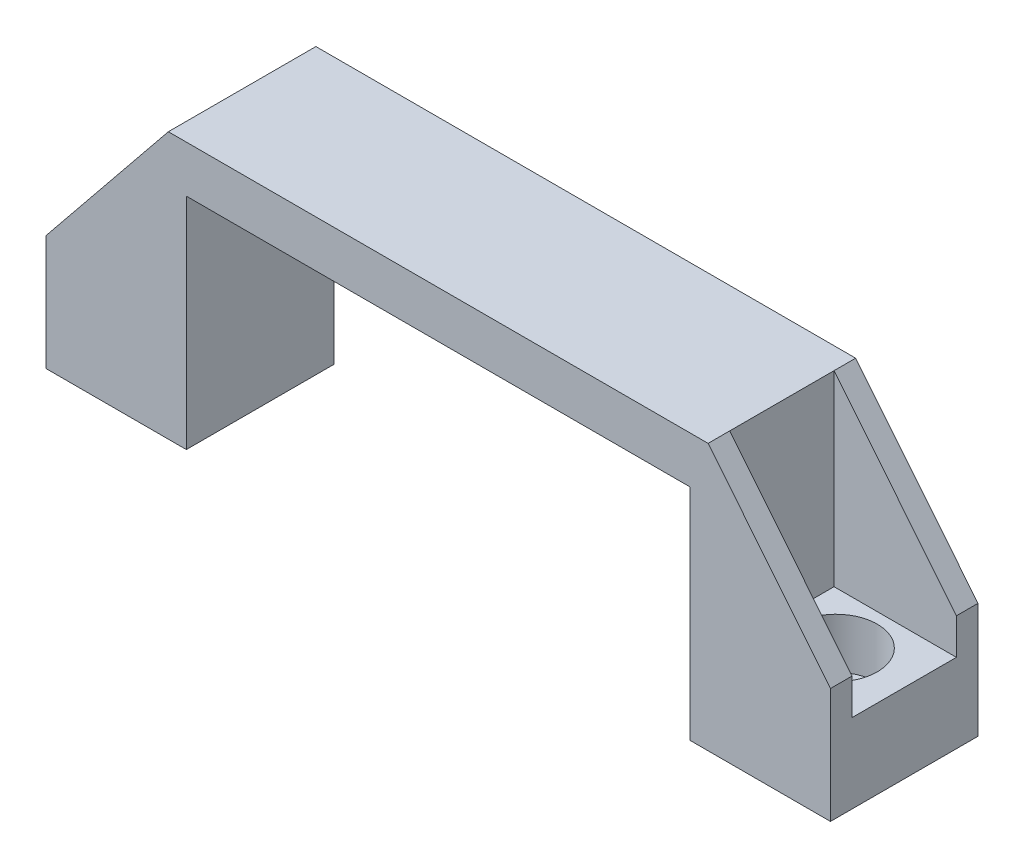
ISO-10303-21;
HEADER;
FILE_DESCRIPTION(('STEP AP214'),'2;1');
FILE_NAME('part.step','',(''),(''),'','','');
FILE_SCHEMA(('AUTOMOTIVE_DESIGN { 1 0 10303 214 1 1 1 1 }'));
ENDSEC;
DATA;
#1=APPLICATION_CONTEXT('core data for automotive mechanical design processes');
#2=APPLICATION_PROTOCOL_DEFINITION('international standard','automotive_design',2000,#1);
#3=PRODUCT_CONTEXT('',#1,'mechanical');
#4=PRODUCT('Part','Part','',(#3));
#5=PRODUCT_RELATED_PRODUCT_CATEGORY('part','',(#4));
#6=PRODUCT_DEFINITION_FORMATION('','',#4);
#7=PRODUCT_DEFINITION_CONTEXT('part definition',#1,'design');
#8=PRODUCT_DEFINITION('design','',#6,#7);
#9=PRODUCT_DEFINITION_SHAPE('','',#8);
#10=(LENGTH_UNIT() NAMED_UNIT(*) SI_UNIT(.MILLI.,.METRE.));
#11=(NAMED_UNIT(*) PLANE_ANGLE_UNIT() SI_UNIT($,.RADIAN.));
#12=(NAMED_UNIT(*) SI_UNIT($,.STERADIAN.) SOLID_ANGLE_UNIT());
#13=UNCERTAINTY_MEASURE_WITH_UNIT(LENGTH_MEASURE(1.E-05),#10,'distance_accuracy_value','');
#14=(GEOMETRIC_REPRESENTATION_CONTEXT(3) GLOBAL_UNCERTAINTY_ASSIGNED_CONTEXT((#13)) GLOBAL_UNIT_ASSIGNED_CONTEXT((#10,
#11,#12)) REPRESENTATION_CONTEXT('',''));
#15=CARTESIAN_POINT('',(0.,0.,0.));
#16=DIRECTION('',(0.,0.,1.));
#17=DIRECTION('',(1.,0.,0.));
#18=AXIS2_PLACEMENT_3D('',#15,#16,#17);
#19=CARTESIAN_POINT('',(45.,37.,0.));
#20=DIRECTION('',(0.,-1.,0.));
#21=DIRECTION('',(0.,0.,-1.));
#22=AXIS2_PLACEMENT_3D('',#19,#20,#21);
#23=CYLINDRICAL_SURFACE('',#22,3.25);
#24=CARTESIAN_POINT('',(45.,0.,0.));
#25=DIRECTION('',(0.,1.,0.));
#26=DIRECTION('',(0.,0.,-1.));
#27=AXIS2_PLACEMENT_3D('',#24,#25,#26);
#28=CIRCLE('',#27,3.25);
#29=CARTESIAN_POINT('',(45.,0.,-3.25));
#30=VERTEX_POINT('',#29);
#31=EDGE_CURVE('E213',#30,#30,#28,.T.);
#32=ORIENTED_EDGE('',*,*,#31,.F.);
#33=EDGE_LOOP('',(#32));
#34=FACE_BOUND('',#33,.T.);
#35=CARTESIAN_POINT('',(45.,3.99999999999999,0.));
#36=DIRECTION('',(0.,1.,0.));
#37=DIRECTION('',(0.,0.,1.));
#38=AXIS2_PLACEMENT_3D('',#35,#36,#37);
#39=CIRCLE('',#38,3.25);
#40=CARTESIAN_POINT('',(45.,3.99999999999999,3.25));
#41=VERTEX_POINT('',#40);
#42=EDGE_CURVE('E37',#41,#41,#39,.T.);
#43=ORIENTED_EDGE('',*,*,#42,.T.);
#44=EDGE_LOOP('',(#43));
#45=FACE_BOUND('',#44,.T.);
#46=ADVANCED_FACE('F33',(#34,#45),#23,.F.);
#47=CARTESIAN_POINT('',(-45.,37.,0.));
#48=DIRECTION('',(0.,-1.,0.));
#49=DIRECTION('',(0.,0.,-1.));
#50=AXIS2_PLACEMENT_3D('',#47,#48,#49);
#51=CYLINDRICAL_SURFACE('',#50,3.25);
#52=CARTESIAN_POINT('',(-45.,0.,0.));
#53=DIRECTION('',(0.,-1.,0.));
#54=DIRECTION('',(0.,0.,-1.));
#55=AXIS2_PLACEMENT_3D('',#52,#53,#54);
#56=CIRCLE('',#55,3.25);
#57=CARTESIAN_POINT('',(-45.,0.,-3.25));
#58=VERTEX_POINT('',#57);
#59=EDGE_CURVE('E220',#58,#58,#56,.T.);
#60=ORIENTED_EDGE('',*,*,#59,.T.);
#61=EDGE_LOOP('',(#60));
#62=FACE_BOUND('',#61,.T.);
#63=CARTESIAN_POINT('',(-45.,3.99999999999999,0.));
#64=DIRECTION('',(0.,1.,0.));
#65=DIRECTION('',(0.,0.,1.));
#66=AXIS2_PLACEMENT_3D('',#63,#64,#65);
#67=CIRCLE('',#66,3.25);
#68=CARTESIAN_POINT('',(-45.,3.99999999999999,3.25));
#69=VERTEX_POINT('',#68);
#70=EDGE_CURVE('E302',#69,#69,#67,.F.);
#71=ORIENTED_EDGE('',*,*,#70,.F.);
#72=EDGE_LOOP('',(#71));
#73=FACE_BOUND('',#72,.T.);
#74=ADVANCED_FACE('F398',(#62,#73),#51,.F.);
#75=CARTESIAN_POINT('',(54.5,16.,10.25));
#76=DIRECTION('',(-0.777244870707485,-0.629198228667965,0.));
#77=DIRECTION('',(0.629198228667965,-0.777244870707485,0.));
#78=AXIS2_PLACEMENT_3D('',#75,#76,#77);
#79=PLANE('',#78);
#80=DIRECTION('',(0.629198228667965,-0.777244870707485,0.));
#81=VECTOR('',#80,1.);
#82=CARTESIAN_POINT('',(54.5,16.,7.25));
#83=LINE('',#82,#81);
#84=CARTESIAN_POINT('',(37.5,37.,7.25));
#85=VERTEX_POINT('',#84);
#86=CARTESIAN_POINT('',(54.5,16.,7.25));
#87=VERTEX_POINT('',#86);
#88=EDGE_CURVE('E192',#85,#87,#83,.T.);
#89=ORIENTED_EDGE('',*,*,#88,.F.);
#90=DIRECTION('',(0.,0.,-1.));
#91=VECTOR('',#90,1.);
#92=CARTESIAN_POINT('',(37.5,37.,10.25));
#93=LINE('',#92,#91);
#94=CARTESIAN_POINT('',(37.5,37.,10.25));
#95=VERTEX_POINT('',#94);
#96=EDGE_CURVE('E277',#95,#85,#93,.T.);
#97=ORIENTED_EDGE('',*,*,#96,.F.);
#98=DIRECTION('',(-0.629198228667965,0.777244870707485,0.));
#99=VECTOR('',#98,1.);
#100=CARTESIAN_POINT('',(54.5,16.,10.25));
#101=LINE('',#100,#99);
#102=CARTESIAN_POINT('',(54.5,16.,10.25));
#103=VERTEX_POINT('',#102);
#104=EDGE_CURVE('E240',#103,#95,#101,.T.);
#105=ORIENTED_EDGE('',*,*,#104,.F.);
#106=DIRECTION('',(0.,0.,-1.));
#107=VECTOR('',#106,1.);
#108=CARTESIAN_POINT('',(54.5,16.,10.25));
#109=LINE('',#108,#107);
#110=EDGE_CURVE('E280',#103,#87,#109,.T.);
#111=ORIENTED_EDGE('',*,*,#110,.T.);
#112=EDGE_LOOP('',(#89,#97,#105,#111));
#113=FACE_BOUND('',#112,.T.);
#114=ADVANCED_FACE('F329',(#113),#79,.F.);
#115=DIRECTION('',(-0.629198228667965,0.777244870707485,0.));
#116=VECTOR('',#115,1.);
#117=CARTESIAN_POINT('',(54.5,16.,-7.25));
#118=LINE('',#117,#116);
#119=CARTESIAN_POINT('',(54.5,16.,-7.25));
#120=VERTEX_POINT('',#119);
#121=CARTESIAN_POINT('',(37.5,37.,-7.25));
#122=VERTEX_POINT('',#121);
#123=EDGE_CURVE('E190',#120,#122,#118,.T.);
#124=ORIENTED_EDGE('',*,*,#123,.F.);
#125=CARTESIAN_POINT('',(54.5,16.,-10.25));
#126=VERTEX_POINT('',#125);
#127=EDGE_CURVE('E183',#120,#126,#109,.T.);
#128=ORIENTED_EDGE('',*,*,#127,.T.);
#129=DIRECTION('',(-0.629198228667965,0.777244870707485,0.));
#130=VECTOR('',#129,1.);
#131=CARTESIAN_POINT('',(54.5,16.,-10.25));
#132=LINE('',#131,#130);
#133=CARTESIAN_POINT('',(37.5,37.,-10.25));
#134=VERTEX_POINT('',#133);
#135=EDGE_CURVE('E261',#126,#134,#132,.T.);
#136=ORIENTED_EDGE('',*,*,#135,.T.);
#137=EDGE_CURVE('E276',#122,#134,#93,.T.);
#138=ORIENTED_EDGE('',*,*,#137,.F.);
#139=EDGE_LOOP('',(#124,#128,#136,#138));
#140=FACE_BOUND('',#139,.T.);
#141=ADVANCED_FACE('F355',(#140),#79,.F.);
#142=CARTESIAN_POINT('',(54.5,0.,10.25));
#143=DIRECTION('',(-1.,0.,0.));
#144=DIRECTION('',(0.,-1.,0.));
#145=AXIS2_PLACEMENT_3D('',#142,#143,#144);
#146=PLANE('',#145);
#147=DIRECTION('',(0.,1.,0.));
#148=VECTOR('',#147,1.);
#149=CARTESIAN_POINT('',(54.5,11.,7.25));
#150=LINE('',#149,#148);
#151=CARTESIAN_POINT('',(54.5,11.,7.25));
#152=VERTEX_POINT('',#151);
#153=EDGE_CURVE('E193',#152,#87,#150,.T.);
#154=ORIENTED_EDGE('',*,*,#153,.T.);
#155=ORIENTED_EDGE('',*,*,#110,.F.);
#156=DIRECTION('',(0.,1.,0.));
#157=VECTOR('',#156,1.);
#158=CARTESIAN_POINT('',(54.5,0.,10.25));
#159=LINE('',#158,#157);
#160=CARTESIAN_POINT('',(54.5,0.,10.25));
#161=VERTEX_POINT('',#160);
#162=EDGE_CURVE('E238',#161,#103,#159,.T.);
#163=ORIENTED_EDGE('',*,*,#162,.F.);
#164=DIRECTION('',(0.,0.,-1.));
#165=VECTOR('',#164,1.);
#166=CARTESIAN_POINT('',(54.5,0.,10.25));
#167=LINE('',#166,#165);
#168=CARTESIAN_POINT('',(54.5,0.,-10.25));
#169=VERTEX_POINT('',#168);
#170=EDGE_CURVE('E283',#161,#169,#167,.T.);
#171=ORIENTED_EDGE('',*,*,#170,.T.);
#172=DIRECTION('',(0.,1.,0.));
#173=VECTOR('',#172,1.);
#174=CARTESIAN_POINT('',(54.5,0.,-10.25));
#175=LINE('',#174,#173);
#176=EDGE_CURVE('E259',#169,#126,#175,.T.);
#177=ORIENTED_EDGE('',*,*,#176,.T.);
#178=ORIENTED_EDGE('',*,*,#127,.F.);
#179=DIRECTION('',(0.,1.,0.));
#180=VECTOR('',#179,1.);
#181=CARTESIAN_POINT('',(54.5,11.,-7.25));
#182=LINE('',#181,#180);
#183=CARTESIAN_POINT('',(54.5,11.,-7.25));
#184=VERTEX_POINT('',#183);
#185=EDGE_CURVE('E165',#184,#120,#182,.T.);
#186=ORIENTED_EDGE('',*,*,#185,.F.);
#187=DIRECTION('',(0.,0.,1.));
#188=VECTOR('',#187,1.);
#189=CARTESIAN_POINT('',(54.5,11.,-7.25));
#190=LINE('',#189,#188);
#191=EDGE_CURVE('E170',#184,#152,#190,.T.);
#192=ORIENTED_EDGE('',*,*,#191,.T.);
#193=EDGE_LOOP('',(#154,#155,#163,#171,#177,#178,#186,#192));
#194=FACE_BOUND('',#193,.T.);
#195=ADVANCED_FACE('F181',(#194),#146,.F.);
#196=CARTESIAN_POINT('',(-37.5,37.,10.25));
#197=DIRECTION('',(0.777244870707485,-0.629198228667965,0.));
#198=DIRECTION('',(0.629198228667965,0.777244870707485,0.));
#199=AXIS2_PLACEMENT_3D('',#196,#197,#198);
#200=PLANE('',#199);
#201=DIRECTION('',(0.,0.,-1.));
#202=VECTOR('',#201,1.);
#203=CARTESIAN_POINT('',(-54.5,16.,10.25));
#204=LINE('',#203,#202);
#205=CARTESIAN_POINT('',(-54.5,16.,-7.25));
#206=VERTEX_POINT('',#205);
#207=CARTESIAN_POINT('',(-54.5,16.,-10.25));
#208=VERTEX_POINT('',#207);
#209=EDGE_CURVE('E246',#206,#208,#204,.T.);
#210=ORIENTED_EDGE('',*,*,#209,.F.);
#211=DIRECTION('',(0.629198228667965,0.777244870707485,0.));
#212=VECTOR('',#211,1.);
#213=CARTESIAN_POINT('',(-37.5,37.,-7.25));
#214=LINE('',#213,#212);
#215=CARTESIAN_POINT('',(-37.5,37.,-7.25));
#216=VERTEX_POINT('',#215);
#217=EDGE_CURVE('E11',#206,#216,#214,.T.);
#218=ORIENTED_EDGE('',*,*,#217,.T.);
#219=DIRECTION('',(0.,0.,-1.));
#220=VECTOR('',#219,1.);
#221=CARTESIAN_POINT('',(-37.5,37.,10.25));
#222=LINE('',#221,#220);
#223=CARTESIAN_POINT('',(-37.5,37.,-10.25));
#224=VERTEX_POINT('',#223);
#225=EDGE_CURVE('E272',#216,#224,#222,.T.);
#226=ORIENTED_EDGE('',*,*,#225,.T.);
#227=DIRECTION('',(-0.629198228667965,-0.777244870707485,0.));
#228=VECTOR('',#227,1.);
#229=CARTESIAN_POINT('',(-37.5,37.,-10.25));
#230=LINE('',#229,#228);
#231=EDGE_CURVE('E228',#224,#208,#230,.T.);
#232=ORIENTED_EDGE('',*,*,#231,.T.);
#233=EDGE_LOOP('',(#210,#218,#226,#232));
#234=FACE_BOUND('',#233,.T.);
#235=ADVANCED_FACE('F359',(#234),#200,.F.);
#236=CARTESIAN_POINT('',(35.,0.,10.25));
#237=DIRECTION('',(0.,1.,0.));
#238=DIRECTION('',(0.,0.,1.));
#239=AXIS2_PLACEMENT_3D('',#236,#237,#238);
#240=PLANE('',#239);
#241=DIRECTION('',(1.,0.,0.));
#242=VECTOR('',#241,1.);
#243=CARTESIAN_POINT('',(35.,0.,-10.25));
#244=LINE('',#243,#242);
#245=CARTESIAN_POINT('',(35.,0.,-10.25));
#246=VERTEX_POINT('',#245);
#247=EDGE_CURVE('E257',#246,#169,#244,.T.);
#248=ORIENTED_EDGE('',*,*,#247,.T.);
#249=ORIENTED_EDGE('',*,*,#170,.F.);
#250=DIRECTION('',(1.,0.,0.));
#251=VECTOR('',#250,1.);
#252=CARTESIAN_POINT('',(35.,0.,10.25));
#253=LINE('',#252,#251);
#254=CARTESIAN_POINT('',(35.,0.,10.25));
#255=VERTEX_POINT('',#254);
#256=EDGE_CURVE('E236',#255,#161,#253,.T.);
#257=ORIENTED_EDGE('',*,*,#256,.F.);
#258=DIRECTION('',(0.,0.,-1.));
#259=VECTOR('',#258,1.);
#260=CARTESIAN_POINT('',(35.,0.,10.25));
#261=LINE('',#260,#259);
#262=EDGE_CURVE('E286',#255,#246,#261,.T.);
#263=ORIENTED_EDGE('',*,*,#262,.T.);
#264=EDGE_LOOP('',(#248,#249,#257,#263));
#265=FACE_BOUND('',#264,.T.);
#266=ORIENTED_EDGE('',*,*,#31,.T.);
#267=EDGE_LOOP('',(#266));
#268=FACE_BOUND('',#267,.T.);
#269=ADVANCED_FACE('F390',(#265,#268),#240,.F.);
#270=CARTESIAN_POINT('',(-54.5,16.,10.25));
#271=DIRECTION('',(1.,0.,0.));
#272=DIRECTION('',(0.,0.,-1.));
#273=AXIS2_PLACEMENT_3D('',#270,#271,#272);
#274=PLANE('',#273);
#275=DIRECTION('',(0.,0.,1.));
#276=VECTOR('',#275,1.);
#277=CARTESIAN_POINT('',(-54.5,11.,-7.25));
#278=LINE('',#277,#276);
#279=CARTESIAN_POINT('',(-54.5,11.,-7.25));
#280=VERTEX_POINT('',#279);
#281=CARTESIAN_POINT('',(-54.5,11.,7.25));
#282=VERTEX_POINT('',#281);
#283=EDGE_CURVE('E196',#280,#282,#278,.T.);
#284=ORIENTED_EDGE('',*,*,#283,.F.);
#285=DIRECTION('',(0.,1.,0.));
#286=VECTOR('',#285,1.);
#287=CARTESIAN_POINT('',(-54.5,11.,-7.25));
#288=LINE('',#287,#286);
#289=EDGE_CURVE('E210',#280,#206,#288,.T.);
#290=ORIENTED_EDGE('',*,*,#289,.T.);
#291=ORIENTED_EDGE('',*,*,#209,.T.);
#292=DIRECTION('',(0.,-1.,0.));
#293=VECTOR('',#292,1.);
#294=CARTESIAN_POINT('',(-54.5,16.,-10.25));
#295=LINE('',#294,#293);
#296=CARTESIAN_POINT('',(-54.5,0.,-10.25));
#297=VERTEX_POINT('',#296);
#298=EDGE_CURVE('E223',#208,#297,#295,.T.);
#299=ORIENTED_EDGE('',*,*,#298,.T.);
#300=DIRECTION('',(0.,0.,-1.));
#301=VECTOR('',#300,1.);
#302=CARTESIAN_POINT('',(-54.5,0.,10.25));
#303=LINE('',#302,#301);
#304=CARTESIAN_POINT('',(-54.5,0.,10.25));
#305=VERTEX_POINT('',#304);
#306=EDGE_CURVE('E298',#305,#297,#303,.T.);
#307=ORIENTED_EDGE('',*,*,#306,.F.);
#308=DIRECTION('',(0.,-1.,0.));
#309=VECTOR('',#308,1.);
#310=CARTESIAN_POINT('',(-54.5,16.,10.25));
#311=LINE('',#310,#309);
#312=CARTESIAN_POINT('',(-54.5,16.,10.25));
#313=VERTEX_POINT('',#312);
#314=EDGE_CURVE('E224',#313,#305,#311,.T.);
#315=ORIENTED_EDGE('',*,*,#314,.F.);
#316=CARTESIAN_POINT('',(-54.5,16.,7.25));
#317=VERTEX_POINT('',#316);
#318=EDGE_CURVE('E269',#313,#317,#204,.T.);
#319=ORIENTED_EDGE('',*,*,#318,.T.);
#320=DIRECTION('',(0.,1.,0.));
#321=VECTOR('',#320,1.);
#322=CARTESIAN_POINT('',(-54.5,11.,7.25));
#323=LINE('',#322,#321);
#324=EDGE_CURVE('E208',#282,#317,#323,.T.);
#325=ORIENTED_EDGE('',*,*,#324,.F.);
#326=EDGE_LOOP('',(#284,#290,#291,#299,#307,#315,#319,#325));
#327=FACE_BOUND('',#326,.T.);
#328=ADVANCED_FACE('F35',(#327),#274,.F.);
#329=CARTESIAN_POINT('',(-54.5,0.,10.25));
#330=DIRECTION('',(0.,1.,0.));
#331=DIRECTION('',(0.,0.,1.));
#332=AXIS2_PLACEMENT_3D('',#329,#330,#331);
#333=PLANE('',#332);
#334=ORIENTED_EDGE('',*,*,#59,.F.);
#335=EDGE_LOOP('',(#334));
#336=FACE_BOUND('',#335,.T.);
#337=DIRECTION('',(1.,0.,0.));
#338=VECTOR('',#337,1.);
#339=CARTESIAN_POINT('',(-54.5,0.,-10.25));
#340=LINE('',#339,#338);
#341=CARTESIAN_POINT('',(-35.,0.,-10.25));
#342=VERTEX_POINT('',#341);
#343=EDGE_CURVE('E249',#297,#342,#340,.T.);
#344=ORIENTED_EDGE('',*,*,#343,.T.);
#345=DIRECTION('',(0.,0.,-1.));
#346=VECTOR('',#345,1.);
#347=CARTESIAN_POINT('',(-35.,0.,10.25));
#348=LINE('',#347,#346);
#349=CARTESIAN_POINT('',(-35.,0.,10.25));
#350=VERTEX_POINT('',#349);
#351=EDGE_CURVE('E295',#350,#342,#348,.T.);
#352=ORIENTED_EDGE('',*,*,#351,.F.);
#353=DIRECTION('',(1.,0.,0.));
#354=VECTOR('',#353,1.);
#355=CARTESIAN_POINT('',(-54.5,0.,10.25));
#356=LINE('',#355,#354);
#357=EDGE_CURVE('E227',#305,#350,#356,.T.);
#358=ORIENTED_EDGE('',*,*,#357,.F.);
#359=ORIENTED_EDGE('',*,*,#306,.T.);
#360=EDGE_LOOP('',(#344,#352,#358,#359));
#361=FACE_BOUND('',#360,.T.);
#362=ADVANCED_FACE('F377',(#336,#361),#333,.F.);
#363=CARTESIAN_POINT('',(-35.,0.,10.25));
#364=DIRECTION('',(-1.,0.,0.));
#365=DIRECTION('',(0.,0.,1.));
#366=AXIS2_PLACEMENT_3D('',#363,#364,#365);
#367=PLANE('',#366);
#368=DIRECTION('',(0.,1.,0.));
#369=VECTOR('',#368,1.);
#370=CARTESIAN_POINT('',(-35.,0.,-10.25));
#371=LINE('',#370,#369);
#372=CARTESIAN_POINT('',(-35.,30.5,-10.25));
#373=VERTEX_POINT('',#372);
#374=EDGE_CURVE('E251',#342,#373,#371,.T.);
#375=ORIENTED_EDGE('',*,*,#374,.T.);
#376=DIRECTION('',(0.,0.,-1.));
#377=VECTOR('',#376,1.);
#378=CARTESIAN_POINT('',(-35.,30.5,10.25));
#379=LINE('',#378,#377);
#380=CARTESIAN_POINT('',(-35.,30.5,10.25));
#381=VERTEX_POINT('',#380);
#382=EDGE_CURVE('E292',#381,#373,#379,.T.);
#383=ORIENTED_EDGE('',*,*,#382,.F.);
#384=DIRECTION('',(0.,1.,0.));
#385=VECTOR('',#384,1.);
#386=CARTESIAN_POINT('',(-35.,0.,10.25));
#387=LINE('',#386,#385);
#388=EDGE_CURVE('E230',#350,#381,#387,.T.);
#389=ORIENTED_EDGE('',*,*,#388,.F.);
#390=ORIENTED_EDGE('',*,*,#351,.T.);
#391=EDGE_LOOP('',(#375,#383,#389,#390));
#392=FACE_BOUND('',#391,.T.);
#393=ADVANCED_FACE('F380',(#392),#367,.F.);
#394=CARTESIAN_POINT('',(-35.,30.5,10.25));
#395=DIRECTION('',(0.,1.,0.));
#396=DIRECTION('',(0.,0.,1.));
#397=AXIS2_PLACEMENT_3D('',#394,#395,#396);
#398=PLANE('',#397);
#399=DIRECTION('',(1.,0.,0.));
#400=VECTOR('',#399,1.);
#401=CARTESIAN_POINT('',(-35.,30.5,-10.25));
#402=LINE('',#401,#400);
#403=CARTESIAN_POINT('',(35.,30.5,-10.25));
#404=VERTEX_POINT('',#403);
#405=EDGE_CURVE('E253',#373,#404,#402,.T.);
#406=ORIENTED_EDGE('',*,*,#405,.T.);
#407=DIRECTION('',(0.,0.,-1.));
#408=VECTOR('',#407,1.);
#409=CARTESIAN_POINT('',(35.,30.5,10.25));
#410=LINE('',#409,#408);
#411=CARTESIAN_POINT('',(35.,30.5,10.25));
#412=VERTEX_POINT('',#411);
#413=EDGE_CURVE('E289',#412,#404,#410,.T.);
#414=ORIENTED_EDGE('',*,*,#413,.F.);
#415=DIRECTION('',(1.,0.,0.));
#416=VECTOR('',#415,1.);
#417=CARTESIAN_POINT('',(-35.,30.5,10.25));
#418=LINE('',#417,#416);
#419=EDGE_CURVE('E232',#381,#412,#418,.T.);
#420=ORIENTED_EDGE('',*,*,#419,.F.);
#421=ORIENTED_EDGE('',*,*,#382,.T.);
#422=EDGE_LOOP('',(#406,#414,#420,#421));
#423=FACE_BOUND('',#422,.T.);
#424=ADVANCED_FACE('F385',(#423),#398,.F.);
#425=CARTESIAN_POINT('',(35.,30.5,10.25));
#426=DIRECTION('',(1.,0.,0.));
#427=DIRECTION('',(0.,1.,0.));
#428=AXIS2_PLACEMENT_3D('',#425,#426,#427);
#429=PLANE('',#428);
#430=DIRECTION('',(0.,-1.,0.));
#431=VECTOR('',#430,1.);
#432=CARTESIAN_POINT('',(35.,30.5,-10.25));
#433=LINE('',#432,#431);
#434=EDGE_CURVE('E255',#404,#246,#433,.T.);
#435=ORIENTED_EDGE('',*,*,#434,.T.);
#436=ORIENTED_EDGE('',*,*,#262,.F.);
#437=DIRECTION('',(0.,-1.,0.));
#438=VECTOR('',#437,1.);
#439=CARTESIAN_POINT('',(35.,30.5,10.25));
#440=LINE('',#439,#438);
#441=EDGE_CURVE('E234',#412,#255,#440,.T.);
#442=ORIENTED_EDGE('',*,*,#441,.F.);
#443=ORIENTED_EDGE('',*,*,#413,.T.);
#444=EDGE_LOOP('',(#435,#436,#442,#443));
#445=FACE_BOUND('',#444,.T.);
#446=ADVANCED_FACE('F389',(#445),#429,.F.);
#447=CARTESIAN_POINT('',(37.5,37.,10.25));
#448=DIRECTION('',(0.,-1.,0.));
#449=DIRECTION('',(0.,0.,-1.));
#450=AXIS2_PLACEMENT_3D('',#447,#448,#449);
#451=PLANE('',#450);
#452=DIRECTION('',(-1.,0.,0.));
#453=VECTOR('',#452,1.);
#454=CARTESIAN_POINT('',(37.5,37.,-10.25));
#455=LINE('',#454,#453);
#456=EDGE_CURVE('E264',#134,#224,#455,.T.);
#457=ORIENTED_EDGE('',*,*,#456,.T.);
#458=ORIENTED_EDGE('',*,*,#225,.F.);
#459=DIRECTION('',(0.,0.,-1.));
#460=VECTOR('',#459,1.);
#461=CARTESIAN_POINT('',(-37.5,37.,-7.25));
#462=LINE('',#461,#460);
#463=CARTESIAN_POINT('',(-37.5,37.,7.25));
#464=VERTEX_POINT('',#463);
#465=EDGE_CURVE('E195',#464,#216,#462,.T.);
#466=ORIENTED_EDGE('',*,*,#465,.F.);
#467=CARTESIAN_POINT('',(-37.5,37.,10.25));
#468=VERTEX_POINT('',#467);
#469=EDGE_CURVE('E273',#468,#464,#222,.T.);
#470=ORIENTED_EDGE('',*,*,#469,.F.);
#471=DIRECTION('',(-1.,0.,0.));
#472=VECTOR('',#471,1.);
#473=CARTESIAN_POINT('',(37.5,37.,10.25));
#474=LINE('',#473,#472);
#475=EDGE_CURVE('E242',#95,#468,#474,.T.);
#476=ORIENTED_EDGE('',*,*,#475,.F.);
#477=ORIENTED_EDGE('',*,*,#96,.T.);
#478=DIRECTION('',(0.,0.,-1.));
#479=VECTOR('',#478,1.);
#480=CARTESIAN_POINT('',(37.5,37.,-7.25));
#481=LINE('',#480,#479);
#482=EDGE_CURVE('E178',#85,#122,#481,.T.);
#483=ORIENTED_EDGE('',*,*,#482,.T.);
#484=ORIENTED_EDGE('',*,*,#137,.T.);
#485=EDGE_LOOP('',(#457,#458,#466,#470,#476,#477,#483,#484));
#486=FACE_BOUND('',#485,.T.);
#487=ADVANCED_FACE('F333',(#486),#451,.F.);
#488=ORIENTED_EDGE('',*,*,#469,.T.);
#489=DIRECTION('',(-0.629198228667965,-0.777244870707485,0.));
#490=VECTOR('',#489,1.);
#491=CARTESIAN_POINT('',(-37.5,37.,7.25));
#492=LINE('',#491,#490);
#493=EDGE_CURVE('E42',#464,#317,#492,.T.);
#494=ORIENTED_EDGE('',*,*,#493,.T.);
#495=ORIENTED_EDGE('',*,*,#318,.F.);
#496=DIRECTION('',(-0.629198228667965,-0.777244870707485,0.));
#497=VECTOR('',#496,1.);
#498=CARTESIAN_POINT('',(-37.5,37.,10.25));
#499=LINE('',#498,#497);
#500=EDGE_CURVE('E244',#468,#313,#499,.T.);
#501=ORIENTED_EDGE('',*,*,#500,.F.);
#502=EDGE_LOOP('',(#488,#494,#495,#501));
#503=FACE_BOUND('',#502,.T.);
#504=ADVANCED_FACE('F370',(#503),#200,.F.);
#505=CARTESIAN_POINT('',(0.,0.,10.25));
#506=DIRECTION('',(0.,0.,1.));
#507=DIRECTION('',(1.,0.,0.));
#508=AXIS2_PLACEMENT_3D('',#505,#506,#507);
#509=PLANE('',#508);
#510=ORIENTED_EDGE('',*,*,#314,.T.);
#511=ORIENTED_EDGE('',*,*,#357,.T.);
#512=ORIENTED_EDGE('',*,*,#388,.T.);
#513=ORIENTED_EDGE('',*,*,#419,.T.);
#514=ORIENTED_EDGE('',*,*,#441,.T.);
#515=ORIENTED_EDGE('',*,*,#256,.T.);
#516=ORIENTED_EDGE('',*,*,#162,.T.);
#517=ORIENTED_EDGE('',*,*,#104,.T.);
#518=ORIENTED_EDGE('',*,*,#475,.T.);
#519=ORIENTED_EDGE('',*,*,#500,.T.);
#520=EDGE_LOOP('',(#510,#511,#512,#513,#514,#515,#516,#517,#518,#519));
#521=FACE_BOUND('',#520,.T.);
#522=ADVANCED_FACE('F338',(#521),#509,.T.);
#523=CARTESIAN_POINT('',(0.,0.,-10.25));
#524=DIRECTION('',(0.,0.,1.));
#525=DIRECTION('',(1.,0.,0.));
#526=AXIS2_PLACEMENT_3D('',#523,#524,#525);
#527=PLANE('',#526);
#528=ORIENTED_EDGE('',*,*,#298,.F.);
#529=ORIENTED_EDGE('',*,*,#231,.F.);
#530=ORIENTED_EDGE('',*,*,#456,.F.);
#531=ORIENTED_EDGE('',*,*,#135,.F.);
#532=ORIENTED_EDGE('',*,*,#176,.F.);
#533=ORIENTED_EDGE('',*,*,#247,.F.);
#534=ORIENTED_EDGE('',*,*,#434,.F.);
#535=ORIENTED_EDGE('',*,*,#405,.F.);
#536=ORIENTED_EDGE('',*,*,#374,.F.);
#537=ORIENTED_EDGE('',*,*,#343,.F.);
#538=EDGE_LOOP('',(#528,#529,#530,#531,#532,#533,#534,#535,#536,#537));
#539=FACE_BOUND('',#538,.T.);
#540=ADVANCED_FACE('F349',(#539),#527,.F.);
#541=CARTESIAN_POINT('',(-54.5,11.,-7.25));
#542=DIRECTION('',(0.,0.,-1.));
#543=DIRECTION('',(-1.,0.,0.));
#544=AXIS2_PLACEMENT_3D('',#541,#542,#543);
#545=PLANE('',#544);
#546=ORIENTED_EDGE('',*,*,#289,.F.);
#547=DIRECTION('',(-1.,0.,0.));
#548=VECTOR('',#547,1.);
#549=CARTESIAN_POINT('',(-54.5,11.,-7.25));
#550=LINE('',#549,#548);
#551=CARTESIAN_POINT('',(-37.5,11.,-7.25));
#552=VERTEX_POINT('',#551);
#553=EDGE_CURVE('E205',#552,#280,#550,.T.);
#554=ORIENTED_EDGE('',*,*,#553,.F.);
#555=DIRECTION('',(0.,1.,0.));
#556=VECTOR('',#555,1.);
#557=CARTESIAN_POINT('',(-37.5,11.,-7.25));
#558=LINE('',#557,#556);
#559=EDGE_CURVE('E214',#552,#216,#558,.T.);
#560=ORIENTED_EDGE('',*,*,#559,.T.);
#561=ORIENTED_EDGE('',*,*,#217,.F.);
#562=EDGE_LOOP('',(#546,#554,#560,#561));
#563=FACE_BOUND('',#562,.T.);
#564=ADVANCED_FACE('F361',(#563),#545,.F.);
#565=CARTESIAN_POINT('',(-54.5,11.,7.25));
#566=DIRECTION('',(0.,0.,1.));
#567=DIRECTION('',(1.,0.,0.));
#568=AXIS2_PLACEMENT_3D('',#565,#566,#567);
#569=PLANE('',#568);
#570=DIRECTION('',(0.,1.,0.));
#571=VECTOR('',#570,1.);
#572=CARTESIAN_POINT('',(-37.5,11.,7.25));
#573=LINE('',#572,#571);
#574=CARTESIAN_POINT('',(-37.5,11.,7.25));
#575=VERTEX_POINT('',#574);
#576=EDGE_CURVE('E58',#575,#464,#573,.T.);
#577=ORIENTED_EDGE('',*,*,#576,.F.);
#578=DIRECTION('',(1.,0.,0.));
#579=VECTOR('',#578,1.);
#580=CARTESIAN_POINT('',(-54.5,11.,7.25));
#581=LINE('',#580,#579);
#582=EDGE_CURVE('E199',#282,#575,#581,.T.);
#583=ORIENTED_EDGE('',*,*,#582,.F.);
#584=ORIENTED_EDGE('',*,*,#324,.T.);
#585=ORIENTED_EDGE('',*,*,#493,.F.);
#586=EDGE_LOOP('',(#577,#583,#584,#585));
#587=FACE_BOUND('',#586,.T.);
#588=ADVANCED_FACE('F430',(#587),#569,.F.);
#589=CARTESIAN_POINT('',(0.,11.,0.));
#590=DIRECTION('',(0.,1.,0.));
#591=DIRECTION('',(0.,0.,1.));
#592=AXIS2_PLACEMENT_3D('',#589,#590,#591);
#593=PLANE('',#592);
#594=CARTESIAN_POINT('',(-45.,11.,0.));
#595=DIRECTION('',(0.,1.,0.));
#596=DIRECTION('',(0.,0.,1.));
#597=AXIS2_PLACEMENT_3D('',#594,#595,#596);
#598=CIRCLE('',#597,5.75);
#599=CARTESIAN_POINT('',(-45.,11.,5.75));
#600=VERTEX_POINT('',#599);
#601=EDGE_CURVE('E310',#600,#600,#598,.T.);
#602=ORIENTED_EDGE('',*,*,#601,.F.);
#603=EDGE_LOOP('',(#602));
#604=FACE_BOUND('',#603,.T.);
#605=ORIENTED_EDGE('',*,*,#283,.T.);
#606=ORIENTED_EDGE('',*,*,#582,.T.);
#607=DIRECTION('',(0.,0.,-1.));
#608=VECTOR('',#607,1.);
#609=CARTESIAN_POINT('',(-37.5,11.,-7.25));
#610=LINE('',#609,#608);
#611=EDGE_CURVE('E202',#575,#552,#610,.T.);
#612=ORIENTED_EDGE('',*,*,#611,.T.);
#613=ORIENTED_EDGE('',*,*,#553,.T.);
#614=EDGE_LOOP('',(#605,#606,#612,#613));
#615=FACE_BOUND('',#614,.T.);
#616=ADVANCED_FACE('F367',(#604,#615),#593,.T.);
#617=CARTESIAN_POINT('',(-37.5,11.,-7.25));
#618=DIRECTION('',(1.,0.,0.));
#619=DIRECTION('',(0.,0.,-1.));
#620=AXIS2_PLACEMENT_3D('',#617,#618,#619);
#621=PLANE('',#620);
#622=ORIENTED_EDGE('',*,*,#465,.T.);
#623=ORIENTED_EDGE('',*,*,#559,.F.);
#624=ORIENTED_EDGE('',*,*,#611,.F.);
#625=ORIENTED_EDGE('',*,*,#576,.T.);
#626=EDGE_LOOP('',(#622,#623,#624,#625));
#627=FACE_BOUND('',#626,.T.);
#628=ADVANCED_FACE('F368',(#627),#621,.F.);
#629=CARTESIAN_POINT('',(54.5,11.,7.25));
#630=DIRECTION('',(0.,0.,-1.));
#631=DIRECTION('',(-1.,0.,0.));
#632=AXIS2_PLACEMENT_3D('',#629,#630,#631);
#633=PLANE('',#632);
#634=ORIENTED_EDGE('',*,*,#88,.T.);
#635=ORIENTED_EDGE('',*,*,#153,.F.);
#636=DIRECTION('',(-1.,0.,0.));
#637=VECTOR('',#636,1.);
#638=CARTESIAN_POINT('',(54.5,11.,7.25));
#639=LINE('',#638,#637);
#640=CARTESIAN_POINT('',(37.5,11.,7.25));
#641=VERTEX_POINT('',#640);
#642=EDGE_CURVE('E174',#152,#641,#639,.T.);
#643=ORIENTED_EDGE('',*,*,#642,.T.);
#644=DIRECTION('',(0.,1.,0.));
#645=VECTOR('',#644,1.);
#646=CARTESIAN_POINT('',(37.5,11.,7.25));
#647=LINE('',#646,#645);
#648=EDGE_CURVE('E185',#641,#85,#647,.T.);
#649=ORIENTED_EDGE('',*,*,#648,.T.);
#650=EDGE_LOOP('',(#634,#635,#643,#649));
#651=FACE_BOUND('',#650,.T.);
#652=ADVANCED_FACE('F323',(#651),#633,.T.);
#653=CARTESIAN_POINT('',(54.5,11.,-7.25));
#654=DIRECTION('',(0.,0.,1.));
#655=DIRECTION('',(1.,0.,0.));
#656=AXIS2_PLACEMENT_3D('',#653,#654,#655);
#657=PLANE('',#656);
#658=ORIENTED_EDGE('',*,*,#123,.T.);
#659=DIRECTION('',(0.,1.,0.));
#660=VECTOR('',#659,1.);
#661=CARTESIAN_POINT('',(37.5,11.,-7.25));
#662=LINE('',#661,#660);
#663=CARTESIAN_POINT('',(37.5,11.,-7.25));
#664=VERTEX_POINT('',#663);
#665=EDGE_CURVE('E50',#664,#122,#662,.T.);
#666=ORIENTED_EDGE('',*,*,#665,.F.);
#667=DIRECTION('',(1.,0.,0.));
#668=VECTOR('',#667,1.);
#669=CARTESIAN_POINT('',(54.5,11.,-7.25));
#670=LINE('',#669,#668);
#671=EDGE_CURVE('E161',#664,#184,#670,.T.);
#672=ORIENTED_EDGE('',*,*,#671,.T.);
#673=ORIENTED_EDGE('',*,*,#185,.T.);
#674=EDGE_LOOP('',(#658,#666,#672,#673));
#675=FACE_BOUND('',#674,.T.);
#676=ADVANCED_FACE('F163',(#675),#657,.T.);
#677=CARTESIAN_POINT('',(37.5,11.,-7.25));
#678=DIRECTION('',(1.,0.,0.));
#679=DIRECTION('',(0.,0.,-1.));
#680=AXIS2_PLACEMENT_3D('',#677,#678,#679);
#681=PLANE('',#680);
#682=ORIENTED_EDGE('',*,*,#482,.F.);
#683=ORIENTED_EDGE('',*,*,#648,.F.);
#684=DIRECTION('',(0.,0.,-1.));
#685=VECTOR('',#684,1.);
#686=CARTESIAN_POINT('',(37.5,11.,-7.25));
#687=LINE('',#686,#685);
#688=EDGE_CURVE('E169',#641,#664,#687,.T.);
#689=ORIENTED_EDGE('',*,*,#688,.T.);
#690=ORIENTED_EDGE('',*,*,#665,.T.);
#691=EDGE_LOOP('',(#682,#683,#689,#690));
#692=FACE_BOUND('',#691,.T.);
#693=ADVANCED_FACE('F325',(#692),#681,.T.);
#694=CARTESIAN_POINT('',(0.,11.,0.));
#695=DIRECTION('',(0.,1.,0.));
#696=DIRECTION('',(0.,0.,1.));
#697=AXIS2_PLACEMENT_3D('',#694,#695,#696);
#698=PLANE('',#697);
#699=CARTESIAN_POINT('',(45.,11.,0.));
#700=DIRECTION('',(0.,1.,0.));
#701=DIRECTION('',(0.,0.,1.));
#702=AXIS2_PLACEMENT_3D('',#699,#700,#701);
#703=CIRCLE('',#702,5.75);
#704=CARTESIAN_POINT('',(45.,11.,5.75));
#705=VERTEX_POINT('',#704);
#706=EDGE_CURVE('E317',#705,#705,#703,.T.);
#707=ORIENTED_EDGE('',*,*,#706,.F.);
#708=EDGE_LOOP('',(#707));
#709=FACE_BOUND('',#708,.T.);
#710=ORIENTED_EDGE('',*,*,#191,.F.);
#711=ORIENTED_EDGE('',*,*,#671,.F.);
#712=ORIENTED_EDGE('',*,*,#688,.F.);
#713=ORIENTED_EDGE('',*,*,#642,.F.);
#714=EDGE_LOOP('',(#710,#711,#712,#713));
#715=FACE_BOUND('',#714,.T.);
#716=ADVANCED_FACE('F173',(#709,#715),#698,.T.);
#717=CARTESIAN_POINT('',(-45.,3.99999999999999,0.));
#718=DIRECTION('',(0.,1.,0.));
#719=DIRECTION('',(0.,0.,1.));
#720=AXIS2_PLACEMENT_3D('',#717,#718,#719);
#721=PLANE('',#720);
#722=CARTESIAN_POINT('',(-45.,3.99999999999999,0.));
#723=DIRECTION('',(0.,1.,0.));
#724=DIRECTION('',(0.,0.,1.));
#725=AXIS2_PLACEMENT_3D('',#722,#723,#724);
#726=CIRCLE('',#725,5.75);
#727=CARTESIAN_POINT('',(-45.,3.99999999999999,5.75));
#728=VERTEX_POINT('',#727);
#729=EDGE_CURVE('E304',#728,#728,#726,.T.);
#730=ORIENTED_EDGE('',*,*,#729,.T.);
#731=EDGE_LOOP('',(#730));
#732=FACE_BOUND('',#731,.T.);
#733=ORIENTED_EDGE('',*,*,#70,.T.);
#734=EDGE_LOOP('',(#733));
#735=FACE_BOUND('',#734,.T.);
#736=ADVANCED_FACE('F413',(#732,#735),#721,.T.);
#737=CARTESIAN_POINT('',(-45.,3.99999999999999,0.));
#738=DIRECTION('',(0.,1.,0.));
#739=DIRECTION('',(0.,0.,1.));
#740=AXIS2_PLACEMENT_3D('',#737,#738,#739);
#741=CYLINDRICAL_SURFACE('',#740,5.75);
#742=ORIENTED_EDGE('',*,*,#729,.F.);
#743=EDGE_LOOP('',(#742));
#744=FACE_BOUND('',#743,.T.);
#745=ORIENTED_EDGE('',*,*,#601,.T.);
#746=EDGE_LOOP('',(#745));
#747=FACE_BOUND('',#746,.T.);
#748=ADVANCED_FACE('F419',(#744,#747),#741,.F.);
#749=CARTESIAN_POINT('',(45.,3.99999999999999,0.));
#750=DIRECTION('',(0.,1.,0.));
#751=DIRECTION('',(0.,0.,1.));
#752=AXIS2_PLACEMENT_3D('',#749,#750,#751);
#753=CYLINDRICAL_SURFACE('',#752,5.75);
#754=CARTESIAN_POINT('',(45.,3.99999999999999,0.));
#755=DIRECTION('',(0.,1.,0.));
#756=DIRECTION('',(0.,0.,1.));
#757=AXIS2_PLACEMENT_3D('',#754,#755,#756);
#758=CIRCLE('',#757,5.75);
#759=CARTESIAN_POINT('',(45.,3.99999999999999,5.75));
#760=VERTEX_POINT('',#759);
#761=EDGE_CURVE('E403',#760,#760,#758,.T.);
#762=ORIENTED_EDGE('',*,*,#761,.F.);
#763=EDGE_LOOP('',(#762));
#764=FACE_BOUND('',#763,.T.);
#765=ORIENTED_EDGE('',*,*,#706,.T.);
#766=EDGE_LOOP('',(#765));
#767=FACE_BOUND('',#766,.T.);
#768=ADVANCED_FACE('F410',(#764,#767),#753,.F.);
#769=CARTESIAN_POINT('',(45.,3.99999999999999,0.));
#770=DIRECTION('',(0.,1.,0.));
#771=DIRECTION('',(0.,0.,1.));
#772=AXIS2_PLACEMENT_3D('',#769,#770,#771);
#773=PLANE('',#772);
#774=ORIENTED_EDGE('',*,*,#42,.F.);
#775=EDGE_LOOP('',(#774));
#776=FACE_BOUND('',#775,.T.);
#777=ORIENTED_EDGE('',*,*,#761,.T.);
#778=EDGE_LOOP('',(#777));
#779=FACE_BOUND('',#778,.T.);
#780=ADVANCED_FACE('F604',(#776,#779),#773,.T.);
#781=CLOSED_SHELL('',(#46,#74,#114,#141,#195,#235,#269,#328,#362,#393,#424,#446,#487,#504,#522,
#540,#564,#588,#616,#628,#652,#676,#693,#716,#736,#748,#768,#780));
#782=MANIFOLD_SOLID_BREP('B2',#781);
#783=ADVANCED_BREP_SHAPE_REPRESENTATION('',(#18,#782),#14);
#784=SHAPE_DEFINITION_REPRESENTATION(#9,#783);
ENDSEC;
END-ISO-10303-21;
